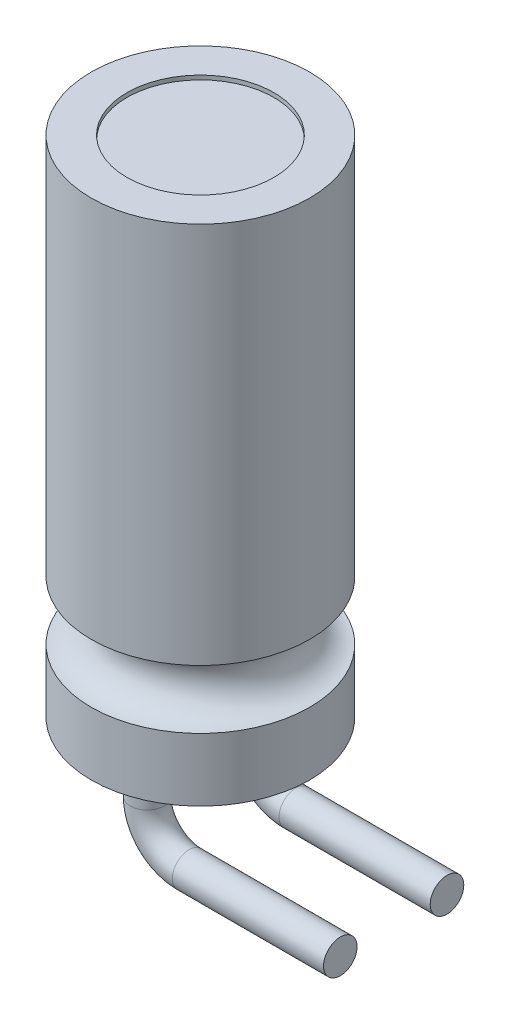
ISO-10303-21;
HEADER;
FILE_DESCRIPTION(('STEP AP214'),'2;1');
FILE_NAME('part.step','',(''),(''),'','','');
FILE_SCHEMA(('AUTOMOTIVE_DESIGN { 1 0 10303 214 1 1 1 1 }'));
ENDSEC;
DATA;
#1=APPLICATION_CONTEXT('core data for automotive mechanical design processes');
#2=APPLICATION_PROTOCOL_DEFINITION('international standard','automotive_design',2000,#1);
#3=PRODUCT_CONTEXT('',#1,'mechanical');
#4=PRODUCT('Part','Part','',(#3));
#5=PRODUCT_RELATED_PRODUCT_CATEGORY('part','',(#4));
#6=PRODUCT_DEFINITION_FORMATION('','',#4);
#7=PRODUCT_DEFINITION_CONTEXT('part definition',#1,'design');
#8=PRODUCT_DEFINITION('design','',#6,#7);
#9=PRODUCT_DEFINITION_SHAPE('','',#8);
#10=(LENGTH_UNIT() NAMED_UNIT(*) SI_UNIT(.MILLI.,.METRE.));
#11=(NAMED_UNIT(*) PLANE_ANGLE_UNIT() SI_UNIT($,.RADIAN.));
#12=(NAMED_UNIT(*) SI_UNIT($,.STERADIAN.) SOLID_ANGLE_UNIT());
#13=UNCERTAINTY_MEASURE_WITH_UNIT(LENGTH_MEASURE(1.E-05),#10,'distance_accuracy_value','');
#14=(GEOMETRIC_REPRESENTATION_CONTEXT(3) GLOBAL_UNCERTAINTY_ASSIGNED_CONTEXT((#13)) GLOBAL_UNIT_ASSIGNED_CONTEXT((#10,
#11,#12)) REPRESENTATION_CONTEXT('',''));
#15=CARTESIAN_POINT('',(0.,0.,0.));
#16=DIRECTION('',(0.,0.,1.));
#17=DIRECTION('',(1.,0.,0.));
#18=AXIS2_PLACEMENT_3D('',#15,#16,#17);
#19=CARTESIAN_POINT('',(2.6,27.5164236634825,0.));
#20=DIRECTION('',(0.,1.,0.));
#21=DIRECTION('',(0.,0.,1.));
#22=AXIS2_PLACEMENT_3D('',#19,#20,#21);
#23=PLANE('',#22);
#24=CARTESIAN_POINT('',(0.,27.5164236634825,-1.27));
#25=DIRECTION('',(0.,1.,0.));
#26=DIRECTION('',(0.,0.,1.));
#27=AXIS2_PLACEMENT_3D('',#24,#25,#26);
#28=CIRCLE('',#27,0.4);
#29=CARTESIAN_POINT('',(0.,27.5164236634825,-0.869999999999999));
#30=VERTEX_POINT('',#29);
#31=EDGE_CURVE('E84',#30,#30,#28,.T.);
#32=ORIENTED_EDGE('',*,*,#31,.T.);
#33=EDGE_LOOP('',(#32));
#34=FACE_BOUND('',#33,.T.);
#35=CARTESIAN_POINT('',(0.,27.5164236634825,0.));
#36=DIRECTION('',(0.,1.,0.));
#37=DIRECTION('',(0.,0.,1.));
#38=AXIS2_PLACEMENT_3D('',#35,#36,#37);
#39=CIRCLE('',#38,2.6);
#40=CARTESIAN_POINT('',(0.,27.5164236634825,2.6));
#41=VERTEX_POINT('',#40);
#42=EDGE_CURVE('E35',#41,#41,#39,.T.);
#43=ORIENTED_EDGE('',*,*,#42,.F.);
#44=EDGE_LOOP('',(#43));
#45=FACE_BOUND('',#44,.T.);
#46=CARTESIAN_POINT('',(0.,27.5164236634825,1.27));
#47=DIRECTION('',(0.,-1.,0.));
#48=DIRECTION('',(0.,0.,-1.));
#49=AXIS2_PLACEMENT_3D('',#46,#47,#48);
#50=CIRCLE('',#49,0.4);
#51=CARTESIAN_POINT('',(0.,27.5164236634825,0.869999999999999));
#52=VERTEX_POINT('',#51);
#53=EDGE_CURVE('E10',#52,#52,#50,.T.);
#54=ORIENTED_EDGE('',*,*,#53,.F.);
#55=EDGE_LOOP('',(#54));
#56=FACE_BOUND('',#55,.T.);
#57=ADVANCED_FACE('F32',(#34,#45,#56),#23,.F.);
#58=CARTESIAN_POINT('',(0.,48.4017094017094,0.));
#59=DIRECTION('',(0.,1.,0.));
#60=DIRECTION('',(0.,0.,1.));
#61=AXIS2_PLACEMENT_3D('',#58,#59,#60);
#62=CYLINDRICAL_SURFACE('',#61,2.6);
#63=CARTESIAN_POINT('',(0.,29.0164236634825,0.));
#64=DIRECTION('',(0.,1.,0.));
#65=DIRECTION('',(0.,0.,1.));
#66=AXIS2_PLACEMENT_3D('',#63,#64,#65);
#67=CIRCLE('',#66,2.6);
#68=CARTESIAN_POINT('',(0.,29.0164236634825,2.6));
#69=VERTEX_POINT('',#68);
#70=EDGE_CURVE('E43',#69,#69,#67,.T.);
#71=ORIENTED_EDGE('',*,*,#70,.F.);
#72=EDGE_LOOP('',(#71));
#73=FACE_BOUND('',#72,.T.);
#74=ORIENTED_EDGE('',*,*,#42,.T.);
#75=EDGE_LOOP('',(#74));
#76=FACE_BOUND('',#75,.T.);
#77=ADVANCED_FACE('F70',(#73,#76),#62,.T.);
#78=CARTESIAN_POINT('',(0.,29.7164236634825,0.));
#79=DIRECTION('',(0.,1.,0.));
#80=DIRECTION('',(0.,0.,1.));
#81=AXIS2_PLACEMENT_3D('',#78,#79,#80);
#82=TOROIDAL_SURFACE('',#81,2.6,0.699999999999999);
#83=CARTESIAN_POINT('',(0.,30.4164236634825,0.));
#84=DIRECTION('',(0.,1.,0.));
#85=DIRECTION('',(0.,0.,1.));
#86=AXIS2_PLACEMENT_3D('',#83,#84,#85);
#87=CIRCLE('',#86,2.6);
#88=CARTESIAN_POINT('',(0.,30.4164236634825,2.6));
#89=VERTEX_POINT('',#88);
#90=EDGE_CURVE('E63',#89,#89,#87,.T.);
#91=ORIENTED_EDGE('',*,*,#90,.F.);
#92=EDGE_LOOP('',(#91));
#93=FACE_BOUND('',#92,.T.);
#94=ORIENTED_EDGE('',*,*,#70,.T.);
#95=EDGE_LOOP('',(#94));
#96=FACE_BOUND('',#95,.T.);
#97=ADVANCED_FACE('F68',(#93,#96),#82,.F.);
#98=CARTESIAN_POINT('',(0.,48.4017094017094,0.));
#99=DIRECTION('',(0.,1.,0.));
#100=DIRECTION('',(0.,0.,1.));
#101=AXIS2_PLACEMENT_3D('',#98,#99,#100);
#102=CYLINDRICAL_SURFACE('',#101,2.6);
#103=CARTESIAN_POINT('',(0.,39.5164236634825,0.));
#104=DIRECTION('',(0.,1.,0.));
#105=DIRECTION('',(0.,0.,1.));
#106=AXIS2_PLACEMENT_3D('',#103,#104,#105);
#107=CIRCLE('',#106,2.6);
#108=CARTESIAN_POINT('',(0.,39.5164236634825,2.6));
#109=VERTEX_POINT('',#108);
#110=EDGE_CURVE('E58',#109,#109,#107,.T.);
#111=ORIENTED_EDGE('',*,*,#110,.F.);
#112=EDGE_LOOP('',(#111));
#113=FACE_BOUND('',#112,.T.);
#114=ORIENTED_EDGE('',*,*,#90,.T.);
#115=EDGE_LOOP('',(#114));
#116=FACE_BOUND('',#115,.T.);
#117=ADVANCED_FACE('F132',(#113,#116),#102,.T.);
#118=CARTESIAN_POINT('',(0.,39.5164236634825,0.));
#119=DIRECTION('',(0.,-1.,0.));
#120=DIRECTION('',(0.,0.,-1.));
#121=AXIS2_PLACEMENT_3D('',#118,#119,#120);
#122=PLANE('',#121);
#123=CARTESIAN_POINT('',(0.,39.5164236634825,0.));
#124=DIRECTION('',(0.,1.,0.));
#125=DIRECTION('',(0.,0.,1.));
#126=AXIS2_PLACEMENT_3D('',#123,#124,#125);
#127=CIRCLE('',#126,1.75);
#128=CARTESIAN_POINT('',(0.,39.5164236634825,1.75));
#129=VERTEX_POINT('',#128);
#130=EDGE_CURVE('E54',#129,#129,#127,.T.);
#131=ORIENTED_EDGE('',*,*,#130,.F.);
#132=EDGE_LOOP('',(#131));
#133=FACE_BOUND('',#132,.T.);
#134=ORIENTED_EDGE('',*,*,#110,.T.);
#135=EDGE_LOOP('',(#134));
#136=FACE_BOUND('',#135,.T.);
#137=ADVANCED_FACE('F128',(#133,#136),#122,.F.);
#138=CARTESIAN_POINT('',(0.,39.4164236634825,0.));
#139=DIRECTION('',(0.,1.,0.));
#140=DIRECTION('',(0.,0.,1.));
#141=AXIS2_PLACEMENT_3D('',#138,#139,#140);
#142=CYLINDRICAL_SURFACE('',#141,1.75);
#143=CARTESIAN_POINT('',(0.,39.4164236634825,0.));
#144=DIRECTION('',(0.,1.,0.));
#145=DIRECTION('',(0.,0.,1.));
#146=AXIS2_PLACEMENT_3D('',#143,#144,#145);
#147=CIRCLE('',#146,1.75);
#148=CARTESIAN_POINT('',(0.,39.4164236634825,1.75));
#149=VERTEX_POINT('',#148);
#150=EDGE_CURVE('E55',#149,#149,#147,.T.);
#151=ORIENTED_EDGE('',*,*,#150,.F.);
#152=EDGE_LOOP('',(#151));
#153=FACE_BOUND('',#152,.T.);
#154=ORIENTED_EDGE('',*,*,#130,.T.);
#155=EDGE_LOOP('',(#154));
#156=FACE_BOUND('',#155,.T.);
#157=ADVANCED_FACE('F124',(#153,#156),#142,.F.);
#158=CARTESIAN_POINT('',(0.,39.4164236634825,0.));
#159=DIRECTION('',(0.,1.,0.));
#160=DIRECTION('',(0.,0.,1.));
#161=AXIS2_PLACEMENT_3D('',#158,#159,#160);
#162=PLANE('',#161);
#163=ORIENTED_EDGE('',*,*,#150,.T.);
#164=EDGE_LOOP('',(#163));
#165=FACE_BOUND('',#164,.T.);
#166=ADVANCED_FACE('F120',(#165),#162,.T.);
#167=CARTESIAN_POINT('',(1.00000000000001,25.5164236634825,1.27));
#168=DIRECTION('',(1.,0.,0.));
#169=DIRECTION('',(0.,0.,-1.));
#170=AXIS2_PLACEMENT_3D('',#167,#168,#169);
#171=CYLINDRICAL_SURFACE('',#170,0.4);
#172=CARTESIAN_POINT('',(1.00000000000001,25.5164236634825,1.27));
#173=DIRECTION('',(1.,0.,0.));
#174=DIRECTION('',(0.,0.,-1.));
#175=AXIS2_PLACEMENT_3D('',#172,#173,#174);
#176=CIRCLE('',#175,0.4);
#177=CARTESIAN_POINT('',(1.00000000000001,25.1164236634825,1.27));
#178=VERTEX_POINT('',#177);
#179=EDGE_CURVE('E48',#178,#178,#176,.T.);
#180=ORIENTED_EDGE('',*,*,#179,.T.);
#181=EDGE_LOOP('',(#180));
#182=FACE_BOUND('',#181,.T.);
#183=CARTESIAN_POINT('',(4.6,25.5164236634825,1.27));
#184=DIRECTION('',(1.,0.,0.));
#185=DIRECTION('',(0.,0.,-1.));
#186=AXIS2_PLACEMENT_3D('',#183,#184,#185);
#187=CIRCLE('',#186,0.4);
#188=CARTESIAN_POINT('',(4.6,25.5164236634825,0.869999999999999));
#189=VERTEX_POINT('',#188);
#190=EDGE_CURVE('E51',#189,#189,#187,.T.);
#191=ORIENTED_EDGE('',*,*,#190,.F.);
#192=EDGE_LOOP('',(#191));
#193=FACE_BOUND('',#192,.T.);
#194=ADVANCED_FACE('F114',(#182,#193),#171,.T.);
#195=CARTESIAN_POINT('',(1.,26.5164236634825,1.27));
#196=DIRECTION('',(0.,0.,1.));
#197=DIRECTION('',(1.,0.,0.));
#198=AXIS2_PLACEMENT_3D('',#195,#196,#197);
#199=TOROIDAL_SURFACE('',#198,1.,0.4);
#200=CARTESIAN_POINT('',(0.,26.5164236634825,1.27));
#201=DIRECTION('',(0.,-1.,0.));
#202=DIRECTION('',(0.,0.,-1.));
#203=AXIS2_PLACEMENT_3D('',#200,#201,#202);
#204=CIRCLE('',#203,0.4);
#205=CARTESIAN_POINT('',(-0.400000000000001,26.5164236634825,1.27));
#206=VERTEX_POINT('',#205);
#207=EDGE_CURVE('E46',#206,#206,#204,.T.);
#208=CARTESIAN_POINT('',(1.,26.5164236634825,1.27));
#209=DIRECTION('',(0.,0.,1.));
#210=DIRECTION('',(1.,0.,0.));
#211=AXIS2_PLACEMENT_3D('',#208,#209,#210);
#212=CIRCLE('',#211,1.4);
#213=EDGE_CURVE('',#206,#178,#212,.T.);
#214=ORIENTED_EDGE('',*,*,#207,.T.);
#215=ORIENTED_EDGE('',*,*,#179,.F.);
#216=ORIENTED_EDGE('',*,*,#213,.T.);
#217=ORIENTED_EDGE('',*,*,#213,.F.);
#218=EDGE_LOOP('',(#214,#216,#215,#217));
#219=FACE_BOUND('',#218,.T.);
#220=ADVANCED_FACE('F100',(#219),#199,.T.);
#221=CARTESIAN_POINT('',(0.,26.5164236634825,1.27));
#222=DIRECTION('',(0.,1.,0.));
#223=DIRECTION('',(0.,0.,1.));
#224=AXIS2_PLACEMENT_3D('',#221,#222,#223);
#225=CYLINDRICAL_SURFACE('',#224,0.4);
#226=ORIENTED_EDGE('',*,*,#207,.F.);
#227=EDGE_LOOP('',(#226));
#228=FACE_BOUND('',#227,.T.);
#229=ORIENTED_EDGE('',*,*,#53,.T.);
#230=EDGE_LOOP('',(#229));
#231=FACE_BOUND('',#230,.T.);
#232=ADVANCED_FACE('F103',(#228,#231),#225,.T.);
#233=CARTESIAN_POINT('',(4.6,25.5164236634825,1.27));
#234=DIRECTION('',(1.,0.,0.));
#235=DIRECTION('',(0.,0.,-1.));
#236=AXIS2_PLACEMENT_3D('',#233,#234,#235);
#237=PLANE('',#236);
#238=ORIENTED_EDGE('',*,*,#190,.T.);
#239=EDGE_LOOP('',(#238));
#240=FACE_BOUND('',#239,.T.);
#241=ADVANCED_FACE('F105',(#240),#237,.T.);
#242=CARTESIAN_POINT('',(1.00000000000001,25.5164236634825,-1.27));
#243=DIRECTION('',(1.,0.,0.));
#244=DIRECTION('',(0.,0.,-1.));
#245=AXIS2_PLACEMENT_3D('',#242,#243,#244);
#246=CYLINDRICAL_SURFACE('',#245,0.4);
#247=CARTESIAN_POINT('',(1.00000000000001,25.5164236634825,-1.27));
#248=DIRECTION('',(-1.,0.,0.));
#249=DIRECTION('',(0.,0.,1.));
#250=AXIS2_PLACEMENT_3D('',#247,#248,#249);
#251=CIRCLE('',#250,0.4);
#252=CARTESIAN_POINT('',(1.00000000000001,25.1164236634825,-1.27));
#253=VERTEX_POINT('',#252);
#254=EDGE_CURVE('E89',#253,#253,#251,.T.);
#255=ORIENTED_EDGE('',*,*,#254,.F.);
#256=EDGE_LOOP('',(#255));
#257=FACE_BOUND('',#256,.T.);
#258=CARTESIAN_POINT('',(4.6,25.5164236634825,-1.27));
#259=DIRECTION('',(-1.,0.,0.));
#260=DIRECTION('',(0.,0.,1.));
#261=AXIS2_PLACEMENT_3D('',#258,#259,#260);
#262=CIRCLE('',#261,0.4);
#263=CARTESIAN_POINT('',(4.6,25.5164236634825,-0.869999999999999));
#264=VERTEX_POINT('',#263);
#265=EDGE_CURVE('E93',#264,#264,#262,.T.);
#266=ORIENTED_EDGE('',*,*,#265,.T.);
#267=EDGE_LOOP('',(#266));
#268=FACE_BOUND('',#267,.T.);
#269=ADVANCED_FACE('F111',(#257,#268),#246,.T.);
#270=CARTESIAN_POINT('',(1.,26.5164236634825,-1.27));
#271=DIRECTION('',(0.,0.,1.));
#272=DIRECTION('',(1.,0.,0.));
#273=AXIS2_PLACEMENT_3D('',#270,#271,#272);
#274=TOROIDAL_SURFACE('',#273,1.,0.4);
#275=CARTESIAN_POINT('',(0.,26.5164236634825,-1.27));
#276=DIRECTION('',(0.,1.,0.));
#277=DIRECTION('',(0.,0.,1.));
#278=AXIS2_PLACEMENT_3D('',#275,#276,#277);
#279=CIRCLE('',#278,0.4);
#280=CARTESIAN_POINT('',(-0.400000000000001,26.5164236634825,-1.27));
#281=VERTEX_POINT('',#280);
#282=EDGE_CURVE('E86',#281,#281,#279,.T.);
#283=CARTESIAN_POINT('',(1.,26.5164236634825,-1.27));
#284=DIRECTION('',(0.,0.,1.));
#285=DIRECTION('',(1.,0.,0.));
#286=AXIS2_PLACEMENT_3D('',#283,#284,#285);
#287=CIRCLE('',#286,1.4);
#288=EDGE_CURVE('',#281,#253,#287,.T.);
#289=ORIENTED_EDGE('',*,*,#282,.F.);
#290=ORIENTED_EDGE('',*,*,#254,.T.);
#291=ORIENTED_EDGE('',*,*,#288,.T.);
#292=ORIENTED_EDGE('',*,*,#288,.F.);
#293=EDGE_LOOP('',(#289,#291,#290,#292));
#294=FACE_BOUND('',#293,.T.);
#295=ADVANCED_FACE('F191',(#294),#274,.T.);
#296=CARTESIAN_POINT('',(0.,26.5164236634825,-1.27));
#297=DIRECTION('',(0.,1.,0.));
#298=DIRECTION('',(0.,0.,1.));
#299=AXIS2_PLACEMENT_3D('',#296,#297,#298);
#300=CYLINDRICAL_SURFACE('',#299,0.4);
#301=ORIENTED_EDGE('',*,*,#282,.T.);
#302=EDGE_LOOP('',(#301));
#303=FACE_BOUND('',#302,.T.);
#304=ORIENTED_EDGE('',*,*,#31,.F.);
#305=EDGE_LOOP('',(#304));
#306=FACE_BOUND('',#305,.T.);
#307=ADVANCED_FACE('F197',(#303,#306),#300,.T.);
#308=CARTESIAN_POINT('',(4.6,25.5164236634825,-1.27));
#309=DIRECTION('',(1.,0.,0.));
#310=DIRECTION('',(0.,0.,1.));
#311=AXIS2_PLACEMENT_3D('',#308,#309,#310);
#312=PLANE('',#311);
#313=ORIENTED_EDGE('',*,*,#265,.F.);
#314=EDGE_LOOP('',(#313));
#315=FACE_BOUND('',#314,.T.);
#316=ADVANCED_FACE('F205',(#315),#312,.T.);
#317=CLOSED_SHELL('',(#57,#77,#97,#117,#137,#157,#166,#194,#220,#232,#241,#269,#295,#307,#316));
#318=MANIFOLD_SOLID_BREP('B2',#317);
#319=ADVANCED_BREP_SHAPE_REPRESENTATION('',(#18,#318),#14);
#320=SHAPE_DEFINITION_REPRESENTATION(#9,#319);
ENDSEC;
END-ISO-10303-21;
